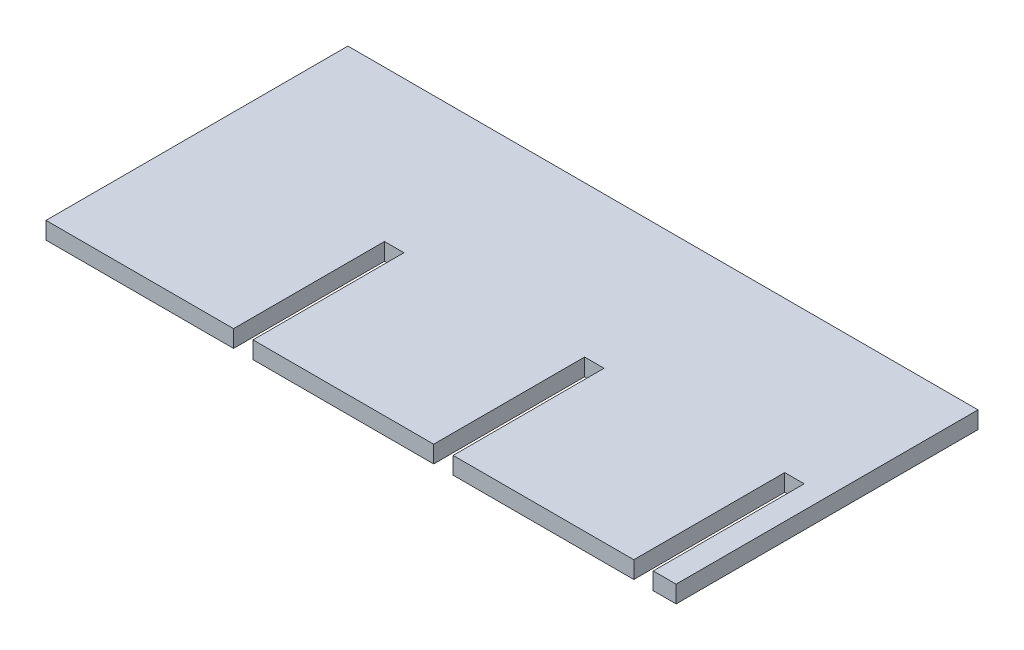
from build123d import *

# Parameters (mm, degrees)
CROQUIS14_W             = 69.5
CROQUIS14_H             = 1.5
SALIENTE_EXTRUIR8_DEPTH = 26.4
CROQUIS17_W             = 1.7
CROQUIS17_H             = 13.2
CORTAR_EXTRUIR1_DEPTH   = 1.5
CROQUIS18_W             = 14.4
CROQUIS18_H             = 26.4
CORTAR_EXTRUIR2_DEPTH   = 1.5


with BuildPart() as part:
    # Croquis14 → Saliente-Extruir8 (new body)
    with BuildSketch(Plane.XY):
        with Locations((0, -20)):
            Rectangle(CROQUIS14_W, CROQUIS14_H)
    extrude(amount=SALIENTE_EXTRUIR8_DEPTH)

    # Croquis17 → Cortar-Extruir1 (cut)
    with BuildSketch(Plane.XZ.offset(20.75)):
        with Locations((-17.5, 19.8)):
            Rectangle(CROQUIS17_W, CROQUIS17_H)
        with Locations((17.5, 19.8)):
            Rectangle(CROQUIS17_W, CROQUIS17_H)
        with Locations((0, 19.8)):
            Rectangle(CROQUIS17_W, CROQUIS17_H)
    extrude(amount=-CORTAR_EXTRUIR1_DEPTH, mode=Mode.SUBTRACT)

    # Croquis18 → Cortar-Extruir2 (cut)
    with BuildSketch(Plane.XZ.offset(20.75)):
        with Locations((27.55, 13.2)):
            Rectangle(CROQUIS18_W, CROQUIS18_H)
    extrude(amount=-CORTAR_EXTRUIR2_DEPTH, mode=Mode.SUBTRACT)


solid = part.part
